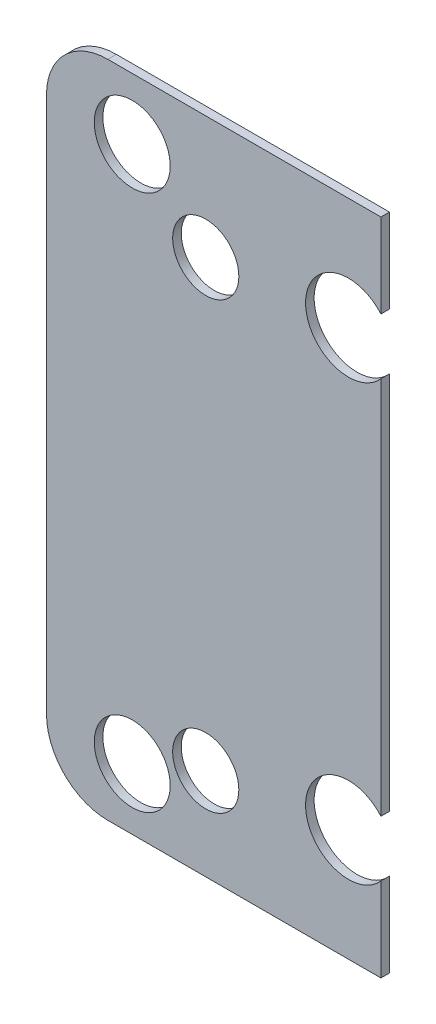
ISO-10303-21;
HEADER;
FILE_DESCRIPTION(('STEP AP214'),'2;1');
FILE_NAME('part.step','',(''),(''),'','','');
FILE_SCHEMA(('AUTOMOTIVE_DESIGN { 1 0 10303 214 1 1 1 1 }'));
ENDSEC;
DATA;
#1=APPLICATION_CONTEXT('core data for automotive mechanical design processes');
#2=APPLICATION_PROTOCOL_DEFINITION('international standard','automotive_design',2000,#1);
#3=PRODUCT_CONTEXT('',#1,'mechanical');
#4=PRODUCT('Part','Part','',(#3));
#5=PRODUCT_RELATED_PRODUCT_CATEGORY('part','',(#4));
#6=PRODUCT_DEFINITION_FORMATION('','',#4);
#7=PRODUCT_DEFINITION_CONTEXT('part definition',#1,'design');
#8=PRODUCT_DEFINITION('design','',#6,#7);
#9=PRODUCT_DEFINITION_SHAPE('','',#8);
#10=(LENGTH_UNIT() NAMED_UNIT(*) SI_UNIT(.MILLI.,.METRE.));
#11=(NAMED_UNIT(*) PLANE_ANGLE_UNIT() SI_UNIT($,.RADIAN.));
#12=(NAMED_UNIT(*) SI_UNIT($,.STERADIAN.) SOLID_ANGLE_UNIT());
#13=UNCERTAINTY_MEASURE_WITH_UNIT(LENGTH_MEASURE(1.E-05),#10,'distance_accuracy_value','');
#14=(GEOMETRIC_REPRESENTATION_CONTEXT(3) GLOBAL_UNCERTAINTY_ASSIGNED_CONTEXT((#13)) GLOBAL_UNIT_ASSIGNED_CONTEXT((#10,
#11,#12)) REPRESENTATION_CONTEXT('',''));
#15=CARTESIAN_POINT('',(0.,0.,0.));
#16=DIRECTION('',(0.,0.,1.));
#17=DIRECTION('',(1.,0.,0.));
#18=AXIS2_PLACEMENT_3D('',#15,#16,#17);
#19=CARTESIAN_POINT('',(0.,0.,0.7));
#20=DIRECTION('',(0.,0.,1.));
#21=DIRECTION('',(1.,0.,0.));
#22=AXIS2_PLACEMENT_3D('',#19,#20,#21);
#23=PLANE('',#22);
#24=CARTESIAN_POINT('',(-21.9,-19.4,0.7));
#25=DIRECTION('',(0.,0.,1.));
#26=DIRECTION('',(1.,0.,0.));
#27=AXIS2_PLACEMENT_3D('',#24,#25,#26);
#28=CIRCLE('',#27,2.7);
#29=CARTESIAN_POINT('',(-19.2,-19.4,0.7));
#30=VERTEX_POINT('',#29);
#31=EDGE_CURVE('E240',#30,#30,#28,.T.);
#32=ORIENTED_EDGE('',*,*,#31,.F.);
#33=EDGE_LOOP('',(#32));
#34=FACE_BOUND('',#33,.T.);
#35=CARTESIAN_POINT('',(-21.9,16.9,0.7));
#36=DIRECTION('',(0.,0.,1.));
#37=DIRECTION('',(1.,0.,0.));
#38=AXIS2_PLACEMENT_3D('',#35,#36,#37);
#39=CIRCLE('',#38,2.7);
#40=CARTESIAN_POINT('',(-19.2,16.9,0.7));
#41=VERTEX_POINT('',#40);
#42=EDGE_CURVE('E313',#41,#41,#39,.T.);
#43=ORIENTED_EDGE('',*,*,#42,.F.);
#44=EDGE_LOOP('',(#43));
#45=FACE_BOUND('',#44,.T.);
#46=CARTESIAN_POINT('',(-27.9,-21.9,0.699999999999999));
#47=DIRECTION('',(0.,0.,1.));
#48=DIRECTION('',(1.,0.,0.));
#49=AXIS2_PLACEMENT_3D('',#46,#47,#48);
#50=CIRCLE('',#49,3.1);
#51=CARTESIAN_POINT('',(-24.8,-21.9,0.699999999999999));
#52=VERTEX_POINT('',#51);
#53=EDGE_CURVE('E200',#52,#52,#50,.T.);
#54=ORIENTED_EDGE('',*,*,#53,.F.);
#55=EDGE_LOOP('',(#54));
#56=FACE_BOUND('',#55,.T.);
#57=CARTESIAN_POINT('',(-27.9,21.9,0.699999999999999));
#58=DIRECTION('',(0.,0.,1.));
#59=DIRECTION('',(1.,0.,0.));
#60=AXIS2_PLACEMENT_3D('',#57,#58,#59);
#61=CIRCLE('',#60,3.1);
#62=CARTESIAN_POINT('',(-24.8,21.9,0.699999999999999));
#63=VERTEX_POINT('',#62);
#64=EDGE_CURVE('E210',#63,#63,#61,.T.);
#65=ORIENTED_EDGE('',*,*,#64,.F.);
#66=EDGE_LOOP('',(#65));
#67=FACE_BOUND('',#66,.T.);
#68=DIRECTION('',(1.,0.,0.));
#69=VECTOR('',#68,1.);
#70=CARTESIAN_POINT('',(0.,-26.9,0.7));
#71=LINE('',#70,#69);
#72=CARTESIAN_POINT('',(-29.9,-26.9,0.7));
#73=VERTEX_POINT('',#72);
#74=CARTESIAN_POINT('',(-7.6,-26.9,0.7));
#75=VERTEX_POINT('',#74);
#76=EDGE_CURVE('E142',#73,#75,#71,.T.);
#77=ORIENTED_EDGE('',*,*,#76,.T.);
#78=DIRECTION('',(0.,1.,0.));
#79=VECTOR('',#78,1.);
#80=CARTESIAN_POINT('',(-7.60000000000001,0.,0.7));
#81=LINE('',#80,#79);
#82=CARTESIAN_POINT('',(-7.60000000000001,-20.0398934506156,0.7));
#83=VERTEX_POINT('',#82);
#84=EDGE_CURVE('E124',#75,#83,#81,.T.);
#85=ORIENTED_EDGE('',*,*,#84,.T.);
#86=CARTESIAN_POINT('',(-10.2500000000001,-17.7535207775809,0.7));
#87=DIRECTION('',(0.,0.,1.));
#88=DIRECTION('',(1.,0.,0.));
#89=AXIS2_PLACEMENT_3D('',#86,#87,#88);
#90=CIRCLE('',#89,3.5);
#91=CARTESIAN_POINT('',(-7.60000000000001,-15.4671481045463,0.7));
#92=VERTEX_POINT('',#91);
#93=EDGE_CURVE('E199',#92,#83,#90,.T.);
#94=ORIENTED_EDGE('',*,*,#93,.F.);
#95=CARTESIAN_POINT('',(-7.60000000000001,15.4671481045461,0.7));
#96=VERTEX_POINT('',#95);
#97=EDGE_CURVE('E135',#92,#96,#81,.T.);
#98=ORIENTED_EDGE('',*,*,#97,.T.);
#99=CARTESIAN_POINT('',(-10.2499999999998,17.7535207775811,0.7));
#100=DIRECTION('',(0.,0.,1.));
#101=DIRECTION('',(1.,0.,0.));
#102=AXIS2_PLACEMENT_3D('',#99,#100,#101);
#103=CIRCLE('',#102,3.5);
#104=CARTESIAN_POINT('',(-7.60000000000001,20.039893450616,0.7));
#105=VERTEX_POINT('',#104);
#106=EDGE_CURVE('E205',#105,#96,#103,.T.);
#107=ORIENTED_EDGE('',*,*,#106,.F.);
#108=CARTESIAN_POINT('',(-7.60000000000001,26.9,0.7));
#109=VERTEX_POINT('',#108);
#110=EDGE_CURVE('E134',#105,#109,#81,.T.);
#111=ORIENTED_EDGE('',*,*,#110,.T.);
#112=DIRECTION('',(1.,0.,0.));
#113=VECTOR('',#112,1.);
#114=CARTESIAN_POINT('',(0.,26.9,0.7));
#115=LINE('',#114,#113);
#116=CARTESIAN_POINT('',(-29.9,26.9,0.7));
#117=VERTEX_POINT('',#116);
#118=EDGE_CURVE('E153',#117,#109,#115,.T.);
#119=ORIENTED_EDGE('',*,*,#118,.F.);
#120=CARTESIAN_POINT('',(-29.9,21.9,0.7));
#121=DIRECTION('',(0.,0.,1.));
#122=DIRECTION('',(1.,0.,0.));
#123=AXIS2_PLACEMENT_3D('',#120,#121,#122);
#124=CIRCLE('',#123,5.);
#125=CARTESIAN_POINT('',(-34.9,21.9,0.699999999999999));
#126=VERTEX_POINT('',#125);
#127=EDGE_CURVE('E163',#126,#117,#124,.F.);
#128=ORIENTED_EDGE('',*,*,#127,.F.);
#129=DIRECTION('',(0.,-1.,0.));
#130=VECTOR('',#129,1.);
#131=CARTESIAN_POINT('',(-34.9,0.,0.7));
#132=LINE('',#131,#130);
#133=CARTESIAN_POINT('',(-34.9,-21.9,0.7));
#134=VERTEX_POINT('',#133);
#135=EDGE_CURVE('E256',#126,#134,#132,.T.);
#136=ORIENTED_EDGE('',*,*,#135,.T.);
#137=CARTESIAN_POINT('',(-29.9,-21.9,0.7));
#138=DIRECTION('',(0.,0.,1.));
#139=DIRECTION('',(1.,0.,0.));
#140=AXIS2_PLACEMENT_3D('',#137,#138,#139);
#141=CIRCLE('',#140,5.);
#142=EDGE_CURVE('E151',#73,#134,#141,.F.);
#143=ORIENTED_EDGE('',*,*,#142,.F.);
#144=EDGE_LOOP('',(#77,#85,#94,#98,#107,#111,#119,#128,#136,#143));
#145=FACE_BOUND('',#144,.T.);
#146=ADVANCED_FACE('F49',(#34,#45,#56,#67,#145),#23,.T.);
#147=CARTESIAN_POINT('',(0.,26.9,-9.3));
#148=DIRECTION('',(0.,-1.,0.));
#149=DIRECTION('',(0.,0.,-1.));
#150=AXIS2_PLACEMENT_3D('',#147,#148,#149);
#151=PLANE('',#150);
#152=DIRECTION('',(0.,0.,1.));
#153=VECTOR('',#152,1.);
#154=CARTESIAN_POINT('',(-7.60000000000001,26.9,-9.3));
#155=LINE('',#154,#153);
#156=CARTESIAN_POINT('',(-7.60000000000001,26.9,0.));
#157=VERTEX_POINT('',#156);
#158=EDGE_CURVE('E147',#157,#109,#155,.T.);
#159=ORIENTED_EDGE('',*,*,#158,.F.);
#160=DIRECTION('',(1.,0.,0.));
#161=VECTOR('',#160,1.);
#162=CARTESIAN_POINT('',(0.,26.9,0.));
#163=LINE('',#162,#161);
#164=CARTESIAN_POINT('',(-29.9,26.9,0.));
#165=VERTEX_POINT('',#164);
#166=EDGE_CURVE('E183',#165,#157,#163,.T.);
#167=ORIENTED_EDGE('',*,*,#166,.F.);
#168=DIRECTION('',(0.,0.,1.));
#169=VECTOR('',#168,1.);
#170=CARTESIAN_POINT('',(-29.9,26.9,-9.3));
#171=LINE('',#170,#169);
#172=EDGE_CURVE('E174',#165,#117,#171,.T.);
#173=ORIENTED_EDGE('',*,*,#172,.T.);
#174=ORIENTED_EDGE('',*,*,#118,.T.);
#175=EDGE_LOOP('',(#159,#167,#173,#174));
#176=FACE_BOUND('',#175,.T.);
#177=ADVANCED_FACE('F250',(#176),#151,.F.);
#178=CARTESIAN_POINT('',(0.,-26.9,-9.3));
#179=DIRECTION('',(0.,-1.,0.));
#180=DIRECTION('',(1.,0.,0.));
#181=AXIS2_PLACEMENT_3D('',#178,#179,#180);
#182=PLANE('',#181);
#183=DIRECTION('',(1.,0.,0.));
#184=VECTOR('',#183,1.);
#185=CARTESIAN_POINT('',(0.,-26.9,0.));
#186=LINE('',#185,#184);
#187=CARTESIAN_POINT('',(-29.9,-26.9,0.));
#188=VERTEX_POINT('',#187);
#189=CARTESIAN_POINT('',(-7.6,-26.9,0.));
#190=VERTEX_POINT('',#189);
#191=EDGE_CURVE('E145',#188,#190,#186,.T.);
#192=ORIENTED_EDGE('',*,*,#191,.T.);
#193=DIRECTION('',(0.,0.,1.));
#194=VECTOR('',#193,1.);
#195=CARTESIAN_POINT('',(-7.6,-26.9,-9.3));
#196=LINE('',#195,#194);
#197=EDGE_CURVE('E127',#190,#75,#196,.T.);
#198=ORIENTED_EDGE('',*,*,#197,.T.);
#199=ORIENTED_EDGE('',*,*,#76,.F.);
#200=DIRECTION('',(0.,0.,1.));
#201=VECTOR('',#200,1.);
#202=CARTESIAN_POINT('',(-29.9,-26.9,-9.3));
#203=LINE('',#202,#201);
#204=EDGE_CURVE('E171',#188,#73,#203,.T.);
#205=ORIENTED_EDGE('',*,*,#204,.F.);
#206=EDGE_LOOP('',(#192,#198,#199,#205));
#207=FACE_BOUND('',#206,.T.);
#208=ADVANCED_FACE('F140',(#207),#182,.T.);
#209=CARTESIAN_POINT('',(0.,0.,0.));
#210=DIRECTION('',(0.,0.,1.));
#211=DIRECTION('',(1.,0.,0.));
#212=AXIS2_PLACEMENT_3D('',#209,#210,#211);
#213=PLANE('',#212);
#214=CARTESIAN_POINT('',(-21.9,-19.4,0.));
#215=DIRECTION('',(0.,0.,1.));
#216=DIRECTION('',(1.,0.,0.));
#217=AXIS2_PLACEMENT_3D('',#214,#215,#216);
#218=CIRCLE('',#217,2.7);
#219=CARTESIAN_POINT('',(-19.2,-19.4,0.));
#220=VERTEX_POINT('',#219);
#221=EDGE_CURVE('E235',#220,#220,#218,.T.);
#222=ORIENTED_EDGE('',*,*,#221,.T.);
#223=EDGE_LOOP('',(#222));
#224=FACE_BOUND('',#223,.T.);
#225=CARTESIAN_POINT('',(-21.9,16.9,0.));
#226=DIRECTION('',(0.,0.,1.));
#227=DIRECTION('',(1.,0.,0.));
#228=AXIS2_PLACEMENT_3D('',#225,#226,#227);
#229=CIRCLE('',#228,2.7);
#230=CARTESIAN_POINT('',(-19.2,16.9,0.));
#231=VERTEX_POINT('',#230);
#232=EDGE_CURVE('E317',#231,#231,#229,.T.);
#233=ORIENTED_EDGE('',*,*,#232,.T.);
#234=EDGE_LOOP('',(#233));
#235=FACE_BOUND('',#234,.T.);
#236=CARTESIAN_POINT('',(-27.9,21.9,0.));
#237=DIRECTION('',(0.,0.,1.));
#238=DIRECTION('',(1.,0.,0.));
#239=AXIS2_PLACEMENT_3D('',#236,#237,#238);
#240=CIRCLE('',#239,3.1);
#241=CARTESIAN_POINT('',(-24.8,21.9,0.));
#242=VERTEX_POINT('',#241);
#243=EDGE_CURVE('E206',#242,#242,#240,.T.);
#244=ORIENTED_EDGE('',*,*,#243,.T.);
#245=EDGE_LOOP('',(#244));
#246=FACE_BOUND('',#245,.T.);
#247=CARTESIAN_POINT('',(-27.9,-21.9,0.));
#248=DIRECTION('',(0.,0.,1.));
#249=DIRECTION('',(1.,0.,0.));
#250=AXIS2_PLACEMENT_3D('',#247,#248,#249);
#251=CIRCLE('',#250,3.1);
#252=CARTESIAN_POINT('',(-24.8,-21.9,0.));
#253=VERTEX_POINT('',#252);
#254=EDGE_CURVE('E211',#253,#253,#251,.T.);
#255=ORIENTED_EDGE('',*,*,#254,.T.);
#256=EDGE_LOOP('',(#255));
#257=FACE_BOUND('',#256,.T.);
#258=DIRECTION('',(0.,1.,0.));
#259=VECTOR('',#258,1.);
#260=CARTESIAN_POINT('',(-7.60000000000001,0.,0.));
#261=LINE('',#260,#259);
#262=CARTESIAN_POINT('',(-7.60000000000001,-20.0398934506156,0.));
#263=VERTEX_POINT('',#262);
#264=EDGE_CURVE('E65',#190,#263,#261,.T.);
#265=ORIENTED_EDGE('',*,*,#264,.F.);
#266=ORIENTED_EDGE('',*,*,#191,.F.);
#267=CARTESIAN_POINT('',(-29.9,-21.9,0.));
#268=DIRECTION('',(0.,0.,1.));
#269=DIRECTION('',(1.,0.,0.));
#270=AXIS2_PLACEMENT_3D('',#267,#268,#269);
#271=CIRCLE('',#270,5.);
#272=CARTESIAN_POINT('',(-34.9,-21.9,0.));
#273=VERTEX_POINT('',#272);
#274=EDGE_CURVE('E189',#188,#273,#271,.F.);
#275=ORIENTED_EDGE('',*,*,#274,.T.);
#276=DIRECTION('',(0.,-1.,0.));
#277=VECTOR('',#276,1.);
#278=CARTESIAN_POINT('',(-34.9,0.,0.));
#279=LINE('',#278,#277);
#280=CARTESIAN_POINT('',(-34.9,21.9,0.));
#281=VERTEX_POINT('',#280);
#282=EDGE_CURVE('E192',#281,#273,#279,.T.);
#283=ORIENTED_EDGE('',*,*,#282,.F.);
#284=CARTESIAN_POINT('',(-29.9,21.9,0.));
#285=DIRECTION('',(0.,0.,1.));
#286=DIRECTION('',(1.,0.,0.));
#287=AXIS2_PLACEMENT_3D('',#284,#285,#286);
#288=CIRCLE('',#287,5.);
#289=EDGE_CURVE('E170',#281,#165,#288,.F.);
#290=ORIENTED_EDGE('',*,*,#289,.T.);
#291=ORIENTED_EDGE('',*,*,#166,.T.);
#292=DIRECTION('',(0.,1.,0.));
#293=VECTOR('',#292,1.);
#294=CARTESIAN_POINT('',(-7.60000000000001,0.,0.));
#295=LINE('',#294,#293);
#296=CARTESIAN_POINT('',(-7.60000000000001,20.039893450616,0.));
#297=VERTEX_POINT('',#296);
#298=EDGE_CURVE('E220',#297,#157,#295,.T.);
#299=ORIENTED_EDGE('',*,*,#298,.F.);
#300=CARTESIAN_POINT('',(-10.2499999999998,17.7535207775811,0.));
#301=DIRECTION('',(0.,0.,1.));
#302=DIRECTION('',(1.,0.,0.));
#303=AXIS2_PLACEMENT_3D('',#300,#301,#302);
#304=CIRCLE('',#303,3.5);
#305=CARTESIAN_POINT('',(-7.60000000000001,15.4671481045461,0.));
#306=VERTEX_POINT('',#305);
#307=EDGE_CURVE('E201',#297,#306,#304,.T.);
#308=ORIENTED_EDGE('',*,*,#307,.T.);
#309=CARTESIAN_POINT('',(-7.60000000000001,-15.4671481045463,0.));
#310=VERTEX_POINT('',#309);
#311=EDGE_CURVE('E72',#310,#306,#261,.T.);
#312=ORIENTED_EDGE('',*,*,#311,.F.);
#313=CARTESIAN_POINT('',(-10.2500000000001,-17.7535207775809,0.));
#314=DIRECTION('',(0.,0.,1.));
#315=DIRECTION('',(1.,0.,0.));
#316=AXIS2_PLACEMENT_3D('',#313,#314,#315);
#317=CIRCLE('',#316,3.5);
#318=EDGE_CURVE('E195',#310,#263,#317,.T.);
#319=ORIENTED_EDGE('',*,*,#318,.T.);
#320=EDGE_LOOP('',(#265,#266,#275,#283,#290,#291,#299,#308,#312,#319));
#321=FACE_BOUND('',#320,.T.);
#322=ADVANCED_FACE('F51',(#224,#235,#246,#257,#321),#213,.F.);
#323=CARTESIAN_POINT('',(-10.2500000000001,-17.7535207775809,-4.3));
#324=DIRECTION('',(0.,0.,1.));
#325=DIRECTION('',(1.,0.,0.));
#326=AXIS2_PLACEMENT_3D('',#323,#324,#325);
#327=CYLINDRICAL_SURFACE('',#326,3.5);
#328=DIRECTION('',(0.,0.,1.));
#329=VECTOR('',#328,1.);
#330=CARTESIAN_POINT('',(-7.60000000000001,-15.4671481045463,-4.3));
#331=LINE('',#330,#329);
#332=EDGE_CURVE('E271',#92,#310,#331,.F.);
#333=ORIENTED_EDGE('',*,*,#332,.F.);
#334=ORIENTED_EDGE('',*,*,#93,.T.);
#335=DIRECTION('',(0.,0.,1.));
#336=VECTOR('',#335,1.);
#337=CARTESIAN_POINT('',(-7.60000000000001,-20.0398934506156,-4.3));
#338=LINE('',#337,#336);
#339=EDGE_CURVE('E128',#263,#83,#338,.T.);
#340=ORIENTED_EDGE('',*,*,#339,.F.);
#341=ORIENTED_EDGE('',*,*,#318,.F.);
#342=EDGE_LOOP('',(#333,#334,#340,#341));
#343=FACE_BOUND('',#342,.T.);
#344=ADVANCED_FACE('F346',(#343),#327,.F.);
#345=CARTESIAN_POINT('',(-10.2499999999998,17.7535207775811,-4.3));
#346=DIRECTION('',(0.,0.,1.));
#347=DIRECTION('',(1.,0.,0.));
#348=AXIS2_PLACEMENT_3D('',#345,#346,#347);
#349=CYLINDRICAL_SURFACE('',#348,3.5);
#350=DIRECTION('',(0.,0.,1.));
#351=VECTOR('',#350,1.);
#352=CARTESIAN_POINT('',(-7.60000000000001,15.4671481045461,-4.3));
#353=LINE('',#352,#351);
#354=EDGE_CURVE('E11',#306,#96,#353,.T.);
#355=ORIENTED_EDGE('',*,*,#354,.F.);
#356=ORIENTED_EDGE('',*,*,#307,.F.);
#357=DIRECTION('',(0.,0.,1.));
#358=VECTOR('',#357,1.);
#359=CARTESIAN_POINT('',(-7.60000000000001,20.039893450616,-4.3));
#360=LINE('',#359,#358);
#361=EDGE_CURVE('E58',#105,#297,#360,.F.);
#362=ORIENTED_EDGE('',*,*,#361,.F.);
#363=ORIENTED_EDGE('',*,*,#106,.T.);
#364=EDGE_LOOP('',(#355,#356,#362,#363));
#365=FACE_BOUND('',#364,.T.);
#366=ADVANCED_FACE('F231',(#365),#349,.F.);
#367=CARTESIAN_POINT('',(-29.9,-21.9,-9.3));
#368=DIRECTION('',(0.,0.,1.));
#369=DIRECTION('',(1.,0.,0.));
#370=AXIS2_PLACEMENT_3D('',#367,#368,#369);
#371=CYLINDRICAL_SURFACE('',#370,5.);
#372=ORIENTED_EDGE('',*,*,#204,.T.);
#373=ORIENTED_EDGE('',*,*,#142,.T.);
#374=DIRECTION('',(0.,0.,1.));
#375=VECTOR('',#374,1.);
#376=CARTESIAN_POINT('',(-34.9,-21.9,-9.3));
#377=LINE('',#376,#375);
#378=EDGE_CURVE('E167',#273,#134,#377,.T.);
#379=ORIENTED_EDGE('',*,*,#378,.F.);
#380=ORIENTED_EDGE('',*,*,#274,.F.);
#381=EDGE_LOOP('',(#372,#373,#379,#380));
#382=FACE_BOUND('',#381,.T.);
#383=ADVANCED_FACE('F360',(#382),#371,.T.);
#384=CARTESIAN_POINT('',(-34.9,0.,-9.3));
#385=DIRECTION('',(-1.,0.,0.));
#386=DIRECTION('',(0.,0.,1.));
#387=AXIS2_PLACEMENT_3D('',#384,#385,#386);
#388=PLANE('',#387);
#389=ORIENTED_EDGE('',*,*,#282,.T.);
#390=ORIENTED_EDGE('',*,*,#378,.T.);
#391=ORIENTED_EDGE('',*,*,#135,.F.);
#392=DIRECTION('',(0.,0.,1.));
#393=VECTOR('',#392,1.);
#394=CARTESIAN_POINT('',(-34.9,21.9,-9.3));
#395=LINE('',#394,#393);
#396=EDGE_CURVE('E159',#281,#126,#395,.T.);
#397=ORIENTED_EDGE('',*,*,#396,.F.);
#398=EDGE_LOOP('',(#389,#390,#391,#397));
#399=FACE_BOUND('',#398,.T.);
#400=ADVANCED_FACE('F366',(#399),#388,.T.);
#401=CARTESIAN_POINT('',(-29.9,21.9,-9.3));
#402=DIRECTION('',(0.,0.,1.));
#403=DIRECTION('',(1.,0.,0.));
#404=AXIS2_PLACEMENT_3D('',#401,#402,#403);
#405=CYLINDRICAL_SURFACE('',#404,5.);
#406=ORIENTED_EDGE('',*,*,#396,.T.);
#407=ORIENTED_EDGE('',*,*,#127,.T.);
#408=ORIENTED_EDGE('',*,*,#172,.F.);
#409=ORIENTED_EDGE('',*,*,#289,.F.);
#410=EDGE_LOOP('',(#406,#407,#408,#409));
#411=FACE_BOUND('',#410,.T.);
#412=ADVANCED_FACE('F253',(#411),#405,.T.);
#413=CARTESIAN_POINT('',(-27.9,21.9,-8.7));
#414=DIRECTION('',(0.,0.,1.));
#415=DIRECTION('',(1.,0.,0.));
#416=AXIS2_PLACEMENT_3D('',#413,#414,#415);
#417=CYLINDRICAL_SURFACE('',#416,3.1);
#418=ORIENTED_EDGE('',*,*,#64,.T.);
#419=EDGE_LOOP('',(#418));
#420=FACE_BOUND('',#419,.T.);
#421=ORIENTED_EDGE('',*,*,#243,.F.);
#422=EDGE_LOOP('',(#421));
#423=FACE_BOUND('',#422,.T.);
#424=ADVANCED_FACE('F338',(#420,#423),#417,.F.);
#425=CARTESIAN_POINT('',(-27.9,-21.9,-8.7));
#426=DIRECTION('',(0.,0.,1.));
#427=DIRECTION('',(1.,0.,0.));
#428=AXIS2_PLACEMENT_3D('',#425,#426,#427);
#429=CYLINDRICAL_SURFACE('',#428,3.1);
#430=ORIENTED_EDGE('',*,*,#53,.T.);
#431=EDGE_LOOP('',(#430));
#432=FACE_BOUND('',#431,.T.);
#433=ORIENTED_EDGE('',*,*,#254,.F.);
#434=EDGE_LOOP('',(#433));
#435=FACE_BOUND('',#434,.T.);
#436=ADVANCED_FACE('F341',(#432,#435),#429,.F.);
#437=CARTESIAN_POINT('',(-7.60000000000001,0.,-9.3));
#438=DIRECTION('',(1.,0.,0.));
#439=DIRECTION('',(0.,0.,-1.));
#440=AXIS2_PLACEMENT_3D('',#437,#438,#439);
#441=PLANE('',#440);
#442=ORIENTED_EDGE('',*,*,#298,.T.);
#443=ORIENTED_EDGE('',*,*,#158,.T.);
#444=ORIENTED_EDGE('',*,*,#110,.F.);
#445=ORIENTED_EDGE('',*,*,#361,.T.);
#446=EDGE_LOOP('',(#442,#443,#444,#445));
#447=FACE_BOUND('',#446,.T.);
#448=ADVANCED_FACE('F219',(#447),#441,.T.);
#449=ORIENTED_EDGE('',*,*,#311,.T.);
#450=ORIENTED_EDGE('',*,*,#354,.T.);
#451=ORIENTED_EDGE('',*,*,#97,.F.);
#452=ORIENTED_EDGE('',*,*,#332,.T.);
#453=EDGE_LOOP('',(#449,#450,#451,#452));
#454=FACE_BOUND('',#453,.T.);
#455=ADVANCED_FACE('F233',(#454),#441,.T.);
#456=ORIENTED_EDGE('',*,*,#264,.T.);
#457=ORIENTED_EDGE('',*,*,#339,.T.);
#458=ORIENTED_EDGE('',*,*,#84,.F.);
#459=ORIENTED_EDGE('',*,*,#197,.F.);
#460=EDGE_LOOP('',(#456,#457,#458,#459));
#461=FACE_BOUND('',#460,.T.);
#462=ADVANCED_FACE('F126',(#461),#441,.T.);
#463=CARTESIAN_POINT('',(-21.9,16.9,0.));
#464=DIRECTION('',(0.,0.,1.));
#465=DIRECTION('',(1.,0.,0.));
#466=AXIS2_PLACEMENT_3D('',#463,#464,#465);
#467=CYLINDRICAL_SURFACE('',#466,2.7);
#468=ORIENTED_EDGE('',*,*,#232,.F.);
#469=EDGE_LOOP('',(#468));
#470=FACE_BOUND('',#469,.T.);
#471=ORIENTED_EDGE('',*,*,#42,.T.);
#472=EDGE_LOOP('',(#471));
#473=FACE_BOUND('',#472,.T.);
#474=ADVANCED_FACE('F324',(#470,#473),#467,.F.);
#475=CARTESIAN_POINT('',(-21.9,-19.4,0.));
#476=DIRECTION('',(0.,0.,1.));
#477=DIRECTION('',(1.,0.,0.));
#478=AXIS2_PLACEMENT_3D('',#475,#476,#477);
#479=CYLINDRICAL_SURFACE('',#478,2.7);
#480=ORIENTED_EDGE('',*,*,#221,.F.);
#481=EDGE_LOOP('',(#480));
#482=FACE_BOUND('',#481,.T.);
#483=ORIENTED_EDGE('',*,*,#31,.T.);
#484=EDGE_LOOP('',(#483));
#485=FACE_BOUND('',#484,.T.);
#486=ADVANCED_FACE('F327',(#482,#485),#479,.F.);
#487=CLOSED_SHELL('',(#146,#177,#208,#322,#344,#366,#383,#400,#412,#424,#436,#448,#455,#462,
#474,#486));
#488=MANIFOLD_SOLID_BREP('B2',#487);
#489=ADVANCED_BREP_SHAPE_REPRESENTATION('',(#18,#488),#14);
#490=SHAPE_DEFINITION_REPRESENTATION(#9,#489);
ENDSEC;
END-ISO-10303-21;
